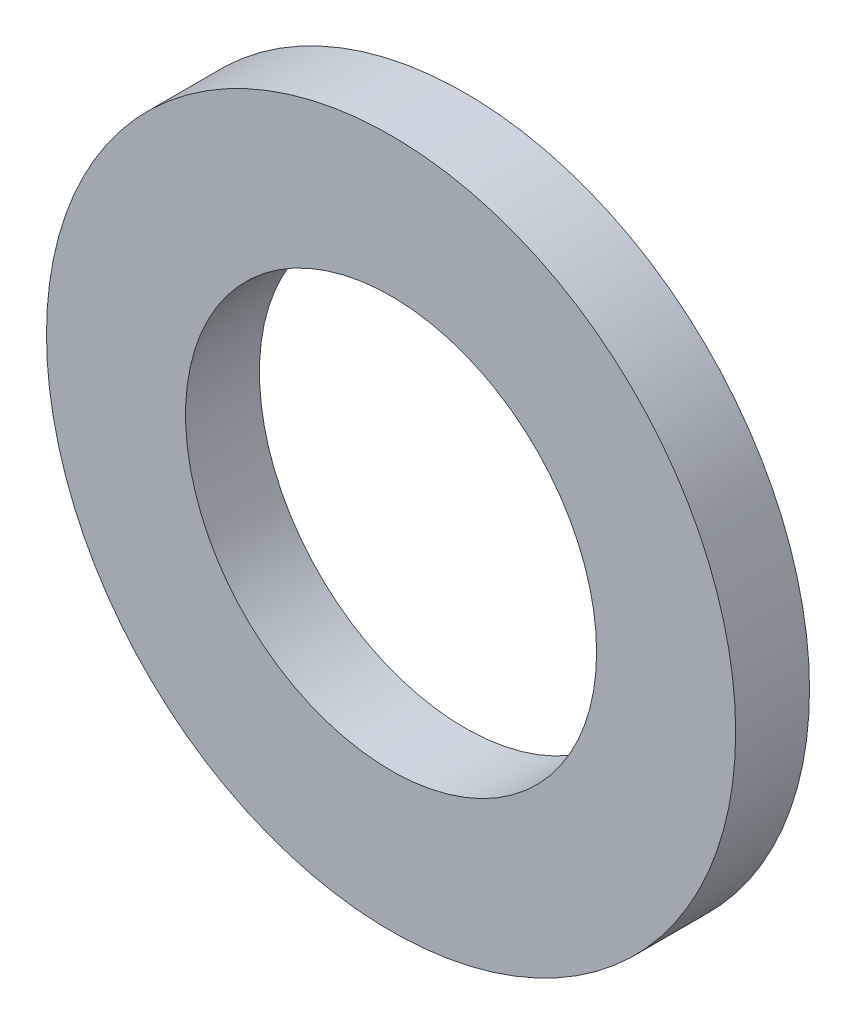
from build123d import *

# Parameters (mm, degrees)
ESQUISSE1_R          = 14
ESQUISSE1_R_2        = 8.35
BASE_EXTRUSION_DEPTH = 3


with BuildPart() as part:
    # Esquisse1 → Base-Extrusion (new body)
    with BuildSketch(Plane.XY):
        Circle(ESQUISSE1_R)
        Circle(ESQUISSE1_R_2, mode=Mode.SUBTRACT)
    extrude(amount=BASE_EXTRUSION_DEPTH)


solid = part.part
